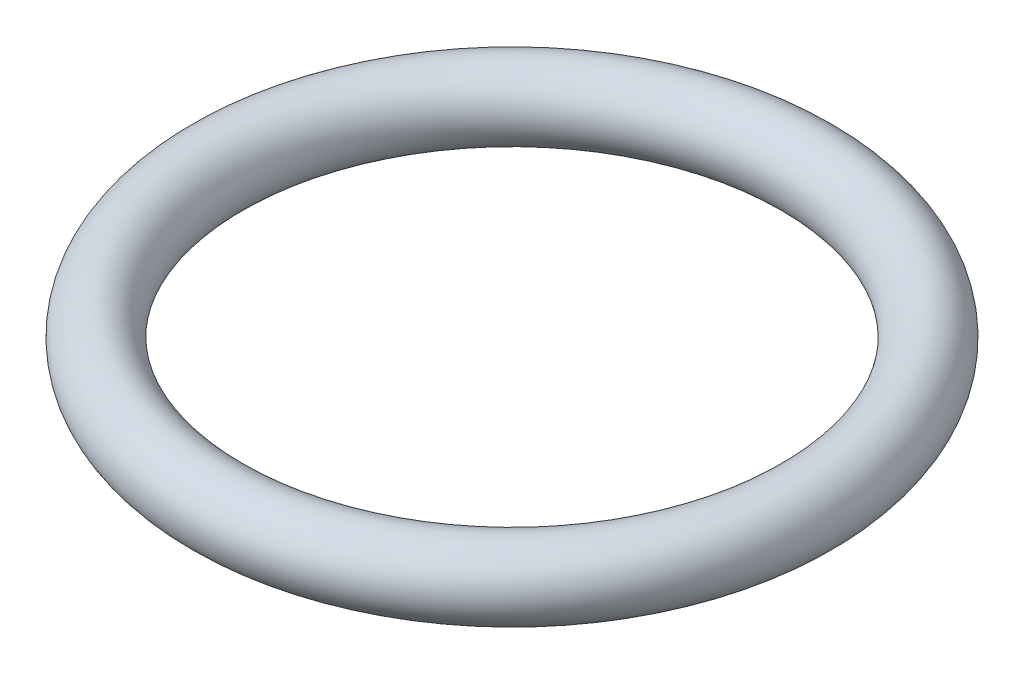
ISO-10303-21;
HEADER;
FILE_DESCRIPTION(('STEP AP214'),'2;1');
FILE_NAME('part.step','',(''),(''),'','','');
FILE_SCHEMA(('AUTOMOTIVE_DESIGN { 1 0 10303 214 1 1 1 1 }'));
ENDSEC;
DATA;
#1=APPLICATION_CONTEXT('core data for automotive mechanical design processes');
#2=APPLICATION_PROTOCOL_DEFINITION('international standard','automotive_design',2000,#1);
#3=PRODUCT_CONTEXT('',#1,'mechanical');
#4=PRODUCT('Part','Part','',(#3));
#5=PRODUCT_RELATED_PRODUCT_CATEGORY('part','',(#4));
#6=PRODUCT_DEFINITION_FORMATION('','',#4);
#7=PRODUCT_DEFINITION_CONTEXT('part definition',#1,'design');
#8=PRODUCT_DEFINITION('design','',#6,#7);
#9=PRODUCT_DEFINITION_SHAPE('','',#8);
#10=(LENGTH_UNIT() NAMED_UNIT(*) SI_UNIT(.MILLI.,.METRE.));
#11=(NAMED_UNIT(*) PLANE_ANGLE_UNIT() SI_UNIT($,.RADIAN.));
#12=(NAMED_UNIT(*) SI_UNIT($,.STERADIAN.) SOLID_ANGLE_UNIT());
#13=UNCERTAINTY_MEASURE_WITH_UNIT(LENGTH_MEASURE(1.E-05),#10,'distance_accuracy_value','');
#14=(GEOMETRIC_REPRESENTATION_CONTEXT(3) GLOBAL_UNCERTAINTY_ASSIGNED_CONTEXT((#13)) GLOBAL_UNIT_ASSIGNED_CONTEXT((#10,
#11,#12)) REPRESENTATION_CONTEXT('',''));
#15=CARTESIAN_POINT('',(0.,0.,0.));
#16=DIRECTION('',(0.,0.,1.));
#17=DIRECTION('',(1.,0.,0.));
#18=AXIS2_PLACEMENT_3D('',#15,#16,#17);
#19=CARTESIAN_POINT('',(0.,3.,0.));
#20=DIRECTION('',(0.,1.,0.));
#21=DIRECTION('',(0.,0.,1.));
#22=AXIS2_PLACEMENT_3D('',#19,#20,#21);
#23=TOROIDAL_SURFACE('',#22,25.,3.00000000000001);
#24=CARTESIAN_POINT('',(0.,3.,28.));
#25=VERTEX_POINT('',#24);
#26=VERTEX_LOOP('',#25);
#27=FACE_BOUND('',#26,.T.);
#28=ADVANCED_FACE('F30',(#27),#23,.T.);
#29=CLOSED_SHELL('',(#28));
#30=MANIFOLD_SOLID_BREP('B2',#29);
#31=ADVANCED_BREP_SHAPE_REPRESENTATION('',(#18,#30),#14);
#32=SHAPE_DEFINITION_REPRESENTATION(#9,#31);
ENDSEC;
END-ISO-10303-21;
